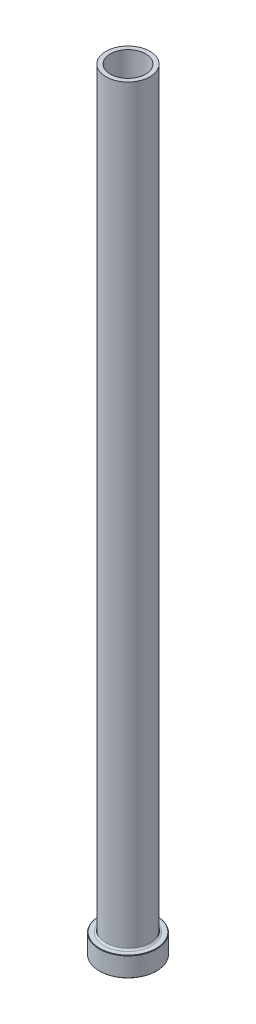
ISO-10303-21;
HEADER;
FILE_DESCRIPTION(('STEP AP214'),'2;1');
FILE_NAME('part.step','',(''),(''),'','','');
FILE_SCHEMA(('AUTOMOTIVE_DESIGN { 1 0 10303 214 1 1 1 1 }'));
ENDSEC;
DATA;
#1=APPLICATION_CONTEXT('core data for automotive mechanical design processes');
#2=APPLICATION_PROTOCOL_DEFINITION('international standard','automotive_design',2000,#1);
#3=PRODUCT_CONTEXT('',#1,'mechanical');
#4=PRODUCT('Part','Part','',(#3));
#5=PRODUCT_RELATED_PRODUCT_CATEGORY('part','',(#4));
#6=PRODUCT_DEFINITION_FORMATION('','',#4);
#7=PRODUCT_DEFINITION_CONTEXT('part definition',#1,'design');
#8=PRODUCT_DEFINITION('design','',#6,#7);
#9=PRODUCT_DEFINITION_SHAPE('','',#8);
#10=(LENGTH_UNIT() NAMED_UNIT(*) SI_UNIT(.MILLI.,.METRE.));
#11=(NAMED_UNIT(*) PLANE_ANGLE_UNIT() SI_UNIT($,.RADIAN.));
#12=(NAMED_UNIT(*) SI_UNIT($,.STERADIAN.) SOLID_ANGLE_UNIT());
#13=UNCERTAINTY_MEASURE_WITH_UNIT(LENGTH_MEASURE(1.E-05),#10,'distance_accuracy_value','');
#14=(GEOMETRIC_REPRESENTATION_CONTEXT(3) GLOBAL_UNCERTAINTY_ASSIGNED_CONTEXT((#13)) GLOBAL_UNIT_ASSIGNED_CONTEXT((#10,
#11,#12)) REPRESENTATION_CONTEXT('',''));
#15=CARTESIAN_POINT('',(0.,0.,0.));
#16=DIRECTION('',(0.,0.,1.));
#17=DIRECTION('',(1.,0.,0.));
#18=AXIS2_PLACEMENT_3D('',#15,#16,#17);
#19=CARTESIAN_POINT('',(0.,92.1876809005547,0.));
#20=DIRECTION('',(0.,1.,0.));
#21=DIRECTION('',(0.,0.,1.));
#22=AXIS2_PLACEMENT_3D('',#19,#20,#21);
#23=CYLINDRICAL_SURFACE('',#22,8.00000000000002);
#24=CARTESIAN_POINT('',(0.,350.,0.));
#25=DIRECTION('',(0.,1.,0.));
#26=DIRECTION('',(0.,0.,1.));
#27=AXIS2_PLACEMENT_3D('',#24,#25,#26);
#28=CIRCLE('',#27,8.00000000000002);
#29=CARTESIAN_POINT('',(0.,350.,8.00000000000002));
#30=VERTEX_POINT('',#29);
#31=EDGE_CURVE('E62',#30,#30,#28,.T.);
#32=ORIENTED_EDGE('',*,*,#31,.T.);
#33=EDGE_LOOP('',(#32));
#34=FACE_BOUND('',#33,.T.);
#35=CARTESIAN_POINT('',(0.,295.,0.));
#36=DIRECTION('',(0.,1.,0.));
#37=DIRECTION('',(0.,0.,1.));
#38=AXIS2_PLACEMENT_3D('',#35,#36,#37);
#39=CIRCLE('',#38,8.00000000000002);
#40=CARTESIAN_POINT('',(0.,295.,8.00000000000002));
#41=VERTEX_POINT('',#40);
#42=EDGE_CURVE('E71',#41,#41,#39,.T.);
#43=ORIENTED_EDGE('',*,*,#42,.F.);
#44=EDGE_LOOP('',(#43));
#45=FACE_BOUND('',#44,.T.);
#46=ADVANCED_FACE('F30',(#34,#45),#23,.F.);
#47=CARTESIAN_POINT('',(-8.00000000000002,350.,0.));
#48=DIRECTION('',(0.,1.,0.));
#49=DIRECTION('',(0.,0.,1.));
#50=AXIS2_PLACEMENT_3D('',#47,#48,#49);
#51=PLANE('',#50);
#52=CARTESIAN_POINT('',(0.,350.,0.));
#53=DIRECTION('',(0.,1.,0.));
#54=DIRECTION('',(0.,0.,1.));
#55=AXIS2_PLACEMENT_3D('',#52,#53,#54);
#56=CIRCLE('',#55,10.);
#57=CARTESIAN_POINT('',(0.,350.,10.));
#58=VERTEX_POINT('',#57);
#59=EDGE_CURVE('E65',#58,#58,#56,.T.);
#60=ORIENTED_EDGE('',*,*,#59,.T.);
#61=EDGE_LOOP('',(#60));
#62=FACE_BOUND('',#61,.T.);
#63=ORIENTED_EDGE('',*,*,#31,.F.);
#64=EDGE_LOOP('',(#63));
#65=FACE_BOUND('',#64,.T.);
#66=ADVANCED_FACE('F79',(#62,#65),#51,.T.);
#67=CARTESIAN_POINT('',(0.,92.1876809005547,0.));
#68=DIRECTION('',(0.,1.,0.));
#69=DIRECTION('',(0.,0.,1.));
#70=AXIS2_PLACEMENT_3D('',#67,#68,#69);
#71=CYLINDRICAL_SURFACE('',#70,10.);
#72=CARTESIAN_POINT('',(0.,9.8,0.));
#73=DIRECTION('',(0.,1.,0.));
#74=DIRECTION('',(0.,0.,1.));
#75=AXIS2_PLACEMENT_3D('',#72,#73,#74);
#76=CIRCLE('',#75,10.);
#77=CARTESIAN_POINT('',(0.,9.8,10.));
#78=VERTEX_POINT('',#77);
#79=EDGE_CURVE('E59',#78,#78,#76,.T.);
#80=ORIENTED_EDGE('',*,*,#79,.T.);
#81=EDGE_LOOP('',(#80));
#82=FACE_BOUND('',#81,.T.);
#83=ORIENTED_EDGE('',*,*,#59,.F.);
#84=EDGE_LOOP('',(#83));
#85=FACE_BOUND('',#84,.T.);
#86=ADVANCED_FACE('F85',(#82,#85),#71,.T.);
#87=CARTESIAN_POINT('',(-9.99999999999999,9.,0.));
#88=DIRECTION('',(0.,1.,0.));
#89=DIRECTION('',(0.,0.,1.));
#90=AXIS2_PLACEMENT_3D('',#87,#88,#89);
#91=PLANE('',#90);
#92=CARTESIAN_POINT('',(0.,9.,0.));
#93=DIRECTION('',(0.,1.,0.));
#94=DIRECTION('',(0.,0.,1.));
#95=AXIS2_PLACEMENT_3D('',#92,#93,#94);
#96=CIRCLE('',#95,12.8);
#97=CARTESIAN_POINT('',(0.,9.,12.8));
#98=VERTEX_POINT('',#97);
#99=EDGE_CURVE('E53',#98,#98,#96,.T.);
#100=ORIENTED_EDGE('',*,*,#99,.T.);
#101=EDGE_LOOP('',(#100));
#102=FACE_BOUND('',#101,.T.);
#103=CARTESIAN_POINT('',(0.,9.,0.));
#104=DIRECTION('',(0.,1.,0.));
#105=DIRECTION('',(0.,0.,1.));
#106=AXIS2_PLACEMENT_3D('',#103,#104,#105);
#107=CIRCLE('',#106,10.8);
#108=CARTESIAN_POINT('',(0.,9.,10.8));
#109=VERTEX_POINT('',#108);
#110=EDGE_CURVE('E56',#109,#109,#107,.F.);
#111=ORIENTED_EDGE('',*,*,#110,.T.);
#112=EDGE_LOOP('',(#111));
#113=FACE_BOUND('',#112,.T.);
#114=ADVANCED_FACE('F111',(#102,#113),#91,.T.);
#115=CARTESIAN_POINT('',(0.,92.1876809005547,0.));
#116=DIRECTION('',(0.,1.,0.));
#117=DIRECTION('',(0.,0.,1.));
#118=AXIS2_PLACEMENT_3D('',#115,#116,#117);
#119=CYLINDRICAL_SURFACE('',#118,13.);
#120=CARTESIAN_POINT('',(0.,8.79999999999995,0.));
#121=DIRECTION('',(0.,1.,0.));
#122=DIRECTION('',(0.,0.,1.));
#123=AXIS2_PLACEMENT_3D('',#120,#121,#122);
#124=CIRCLE('',#123,13.);
#125=CARTESIAN_POINT('',(0.,8.79999999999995,13.));
#126=VERTEX_POINT('',#125);
#127=EDGE_CURVE('E45',#126,#126,#124,.F.);
#128=ORIENTED_EDGE('',*,*,#127,.T.);
#129=EDGE_LOOP('',(#128));
#130=FACE_BOUND('',#129,.T.);
#131=CARTESIAN_POINT('',(0.,0.20000000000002,0.));
#132=DIRECTION('',(0.,-1.,0.));
#133=DIRECTION('',(0.,0.,-1.));
#134=AXIS2_PLACEMENT_3D('',#131,#132,#133);
#135=CIRCLE('',#134,13.);
#136=CARTESIAN_POINT('',(0.,0.20000000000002,-13.));
#137=VERTEX_POINT('',#136);
#138=EDGE_CURVE('E50',#137,#137,#135,.F.);
#139=ORIENTED_EDGE('',*,*,#138,.T.);
#140=EDGE_LOOP('',(#139));
#141=FACE_BOUND('',#140,.T.);
#142=ADVANCED_FACE('F108',(#130,#141),#119,.T.);
#143=CARTESIAN_POINT('',(-13.,0.,0.));
#144=DIRECTION('',(0.,-1.,0.));
#145=DIRECTION('',(0.,0.,-1.));
#146=AXIS2_PLACEMENT_3D('',#143,#144,#145);
#147=PLANE('',#146);
#148=CARTESIAN_POINT('',(0.,0.,0.));
#149=DIRECTION('',(0.,-1.,0.));
#150=DIRECTION('',(0.,0.,-1.));
#151=AXIS2_PLACEMENT_3D('',#148,#149,#150);
#152=CIRCLE('',#151,8.75000000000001);
#153=CARTESIAN_POINT('',(0.,0.,-8.75000000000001));
#154=VERTEX_POINT('',#153);
#155=EDGE_CURVE('E37',#154,#154,#152,.F.);
#156=ORIENTED_EDGE('',*,*,#155,.T.);
#157=EDGE_LOOP('',(#156));
#158=FACE_BOUND('',#157,.T.);
#159=CARTESIAN_POINT('',(0.,0.,0.));
#160=DIRECTION('',(0.,-1.,0.));
#161=DIRECTION('',(0.,0.,-1.));
#162=AXIS2_PLACEMENT_3D('',#159,#160,#161);
#163=CIRCLE('',#162,12.8);
#164=CARTESIAN_POINT('',(0.,0.,-12.8));
#165=VERTEX_POINT('',#164);
#166=EDGE_CURVE('E41',#165,#165,#163,.T.);
#167=ORIENTED_EDGE('',*,*,#166,.T.);
#168=EDGE_LOOP('',(#167));
#169=FACE_BOUND('',#168,.T.);
#170=ADVANCED_FACE('F110',(#158,#169),#147,.T.);
#171=CARTESIAN_POINT('',(0.,92.1876809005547,0.));
#172=DIRECTION('',(0.,1.,0.));
#173=DIRECTION('',(0.,0.,1.));
#174=AXIS2_PLACEMENT_3D('',#171,#172,#173);
#175=CYLINDRICAL_SURFACE('',#174,8.25000000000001);
#176=CARTESIAN_POINT('',(0.,0.5,0.));
#177=DIRECTION('',(0.,-1.,0.));
#178=DIRECTION('',(0.,0.,-1.));
#179=AXIS2_PLACEMENT_3D('',#176,#177,#178);
#180=CIRCLE('',#179,8.25000000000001);
#181=CARTESIAN_POINT('',(0.,0.5,-8.25000000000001));
#182=VERTEX_POINT('',#181);
#183=EDGE_CURVE('E10',#182,#182,#180,.T.);
#184=ORIENTED_EDGE('',*,*,#183,.T.);
#185=EDGE_LOOP('',(#184));
#186=FACE_BOUND('',#185,.T.);
#187=CARTESIAN_POINT('',(0.,283.,0.));
#188=DIRECTION('',(0.,1.,0.));
#189=DIRECTION('',(0.,0.,1.));
#190=AXIS2_PLACEMENT_3D('',#187,#188,#189);
#191=CIRCLE('',#190,8.25000000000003);
#192=CARTESIAN_POINT('',(0.,283.,8.25000000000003));
#193=VERTEX_POINT('',#192);
#194=EDGE_CURVE('E68',#193,#193,#191,.T.);
#195=ORIENTED_EDGE('',*,*,#194,.T.);
#196=EDGE_LOOP('',(#195));
#197=FACE_BOUND('',#196,.T.);
#198=ADVANCED_FACE('F118',(#186,#197),#175,.F.);
#199=CARTESIAN_POINT('',(0.,283.,0.));
#200=DIRECTION('',(0.,-1.,0.));
#201=DIRECTION('',(0.,0.,-1.));
#202=AXIS2_PLACEMENT_3D('',#199,#200,#201);
#203=CONICAL_SURFACE('',#202,8.25000000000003,0.0208303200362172);
#204=ORIENTED_EDGE('',*,*,#42,.T.);
#205=EDGE_LOOP('',(#204));
#206=FACE_BOUND('',#205,.T.);
#207=ORIENTED_EDGE('',*,*,#194,.F.);
#208=EDGE_LOOP('',(#207));
#209=FACE_BOUND('',#208,.T.);
#210=ADVANCED_FACE('F75',(#206,#209),#203,.F.);
#211=CARTESIAN_POINT('',(0.,9.8,0.));
#212=DIRECTION('',(0.,1.,0.));
#213=DIRECTION('',(0.,0.,1.));
#214=AXIS2_PLACEMENT_3D('',#211,#212,#213);
#215=TOROIDAL_SURFACE('',#214,10.8,0.8);
#216=ORIENTED_EDGE('',*,*,#110,.F.);
#217=EDGE_LOOP('',(#216));
#218=FACE_BOUND('',#217,.T.);
#219=ORIENTED_EDGE('',*,*,#79,.F.);
#220=EDGE_LOOP('',(#219));
#221=FACE_BOUND('',#220,.T.);
#222=ADVANCED_FACE('F90',(#218,#221),#215,.F.);
#223=CARTESIAN_POINT('',(0.,8.99999999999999,0.));
#224=DIRECTION('',(0.,-1.,0.));
#225=DIRECTION('',(0.,0.,-1.));
#226=AXIS2_PLACEMENT_3D('',#223,#224,#225);
#227=CONICAL_SURFACE('',#226,12.8,0.785398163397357);
#228=ORIENTED_EDGE('',*,*,#127,.F.);
#229=EDGE_LOOP('',(#228));
#230=FACE_BOUND('',#229,.T.);
#231=ORIENTED_EDGE('',*,*,#99,.F.);
#232=EDGE_LOOP('',(#231));
#233=FACE_BOUND('',#232,.T.);
#234=ADVANCED_FACE('F93',(#230,#233),#227,.T.);
#235=CARTESIAN_POINT('',(0.,0.20000000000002,0.));
#236=DIRECTION('',(0.,1.,0.));
#237=DIRECTION('',(0.,0.,1.));
#238=AXIS2_PLACEMENT_3D('',#235,#236,#237);
#239=CONICAL_SURFACE('',#238,13.,0.785398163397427);
#240=ORIENTED_EDGE('',*,*,#166,.F.);
#241=EDGE_LOOP('',(#240));
#242=FACE_BOUND('',#241,.T.);
#243=ORIENTED_EDGE('',*,*,#138,.F.);
#244=EDGE_LOOP('',(#243));
#245=FACE_BOUND('',#244,.T.);
#246=ADVANCED_FACE('F96',(#242,#245),#239,.T.);
#247=CARTESIAN_POINT('',(0.,0.,0.));
#248=DIRECTION('',(0.,-1.,0.));
#249=DIRECTION('',(0.,0.,-1.));
#250=AXIS2_PLACEMENT_3D('',#247,#248,#249);
#251=CONICAL_SURFACE('',#250,8.75000000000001,0.785398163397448);
#252=ORIENTED_EDGE('',*,*,#183,.F.);
#253=EDGE_LOOP('',(#252));
#254=FACE_BOUND('',#253,.T.);
#255=ORIENTED_EDGE('',*,*,#155,.F.);
#256=EDGE_LOOP('',(#255));
#257=FACE_BOUND('',#256,.T.);
#258=ADVANCED_FACE('F32',(#254,#257),#251,.F.);
#259=CLOSED_SHELL('',(#46,#66,#86,#114,#142,#170,#198,#210,#222,#234,#246,#258));
#260=MANIFOLD_SOLID_BREP('B2',#259);
#261=ADVANCED_BREP_SHAPE_REPRESENTATION('',(#18,#260),#14);
#262=SHAPE_DEFINITION_REPRESENTATION(#9,#261);
ENDSEC;
END-ISO-10303-21;
